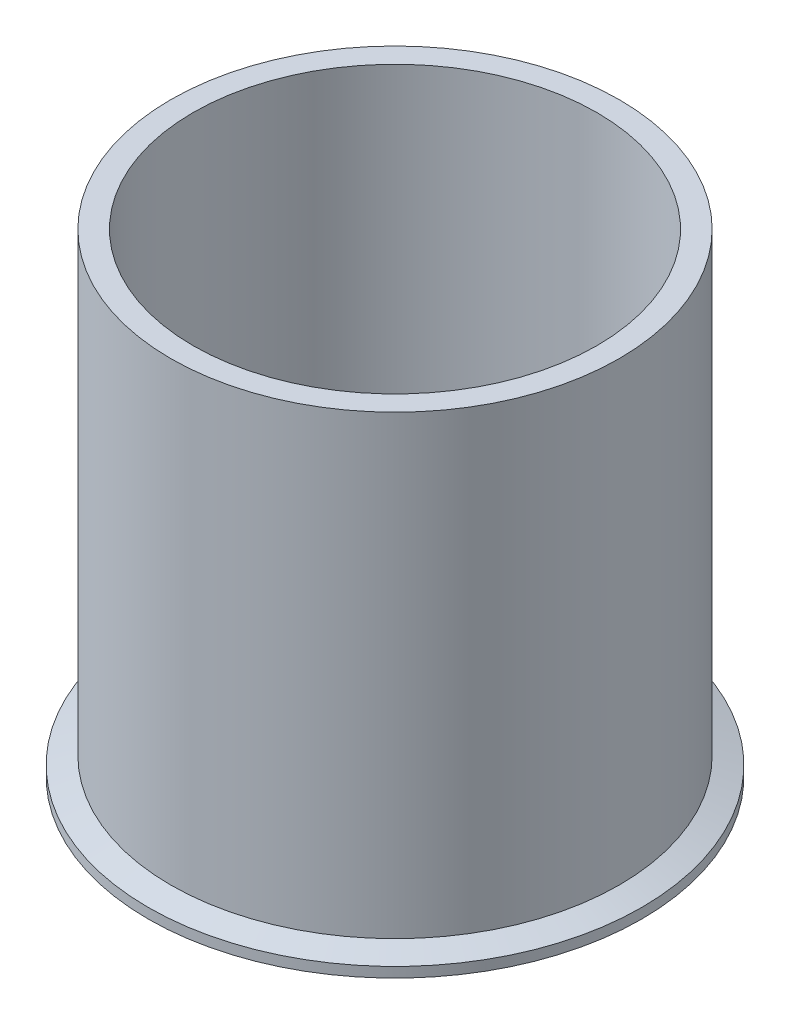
from build123d import *


with BuildPart() as part:
    # Sketch1 → Revolve2 (revolve)
    with BuildSketch(Plane.XY, mode=Mode.PRIVATE) as revolve2_sk:
        with BuildLine():
            Line((-48.6664, 0), (-48.6664, 114.3))
            Line((-48.6664, 114.3), (-54.0512, 114.3))
            Line((-54.0512, 114.3), (-54.0512, 4.407551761))
            Line((-54.0512, 4.407551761), (-59.4614, 2.4384))
            Line((-59.4614, 2.4384), (-59.4614, 0))
            Line((-59.4614, 0), (-56.774260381, 0))
            ThreePointArc((-56.774260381, 0), (-56.353684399, 0.126579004), (-56.072835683, 0.46426288))
            Line((-56.072835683, 0.46426288), (-55.899398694, 0.872854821))
            ThreePointArc((-55.899398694, 0.872854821), (-54.8005, 1.6002), (-53.701601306, 0.872854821))
            Line((-53.701601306, 0.872854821), (-53.528164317, 0.46426288))
            ThreePointArc((-53.528164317, 0.46426288), (-53.247315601, 0.126579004), (-52.826739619, 0))
            Line((-52.826739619, 0), (-48.6664, 0))
        make_face()
    revolve(revolve2_sk.sketch.rotate(Axis((0, 0, 0), (0, 1, 0)), 270), axis=Axis((0, 0, 0), (0, 1, 0)))


solid = part.part
